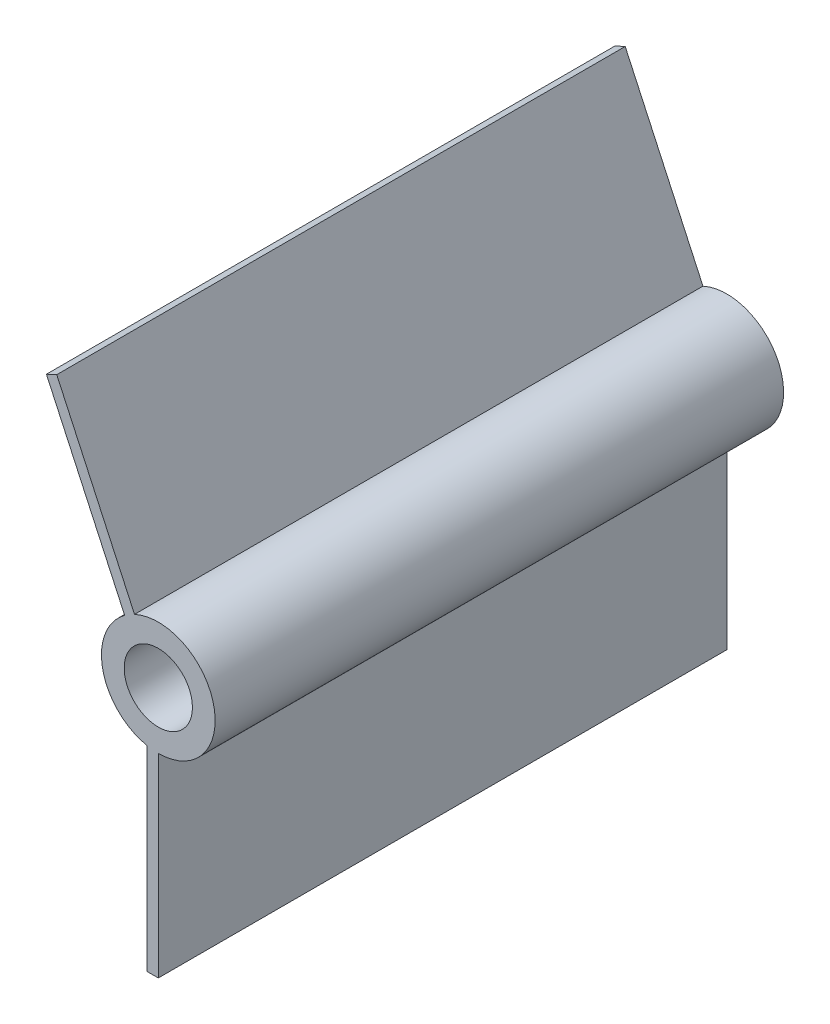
ISO-10303-21;
HEADER;
FILE_DESCRIPTION(('STEP AP214'),'2;1');
FILE_NAME('part.step','',(''),(''),'','','');
FILE_SCHEMA(('AUTOMOTIVE_DESIGN { 1 0 10303 214 1 1 1 1 }'));
ENDSEC;
DATA;
#1=APPLICATION_CONTEXT('core data for automotive mechanical design processes');
#2=APPLICATION_PROTOCOL_DEFINITION('international standard','automotive_design',2000,#1);
#3=PRODUCT_CONTEXT('',#1,'mechanical');
#4=PRODUCT('Part','Part','',(#3));
#5=PRODUCT_RELATED_PRODUCT_CATEGORY('part','',(#4));
#6=PRODUCT_DEFINITION_FORMATION('','',#4);
#7=PRODUCT_DEFINITION_CONTEXT('part definition',#1,'design');
#8=PRODUCT_DEFINITION('design','',#6,#7);
#9=PRODUCT_DEFINITION_SHAPE('','',#8);
#10=(LENGTH_UNIT() NAMED_UNIT(*) SI_UNIT(.MILLI.,.METRE.));
#11=(NAMED_UNIT(*) PLANE_ANGLE_UNIT() SI_UNIT($,.RADIAN.));
#12=(NAMED_UNIT(*) SI_UNIT($,.STERADIAN.) SOLID_ANGLE_UNIT());
#13=UNCERTAINTY_MEASURE_WITH_UNIT(LENGTH_MEASURE(1.E-05),#10,'distance_accuracy_value','');
#14=(GEOMETRIC_REPRESENTATION_CONTEXT(3) GLOBAL_UNCERTAINTY_ASSIGNED_CONTEXT((#13)) GLOBAL_UNIT_ASSIGNED_CONTEXT((#10,
#11,#12)) REPRESENTATION_CONTEXT('',''));
#15=CARTESIAN_POINT('',(0.,0.,0.));
#16=DIRECTION('',(0.,0.,1.));
#17=DIRECTION('',(1.,0.,0.));
#18=AXIS2_PLACEMENT_3D('',#15,#16,#17);
#19=CARTESIAN_POINT('',(-2.,0.,50.));
#20=DIRECTION('',(1.,0.,0.));
#21=DIRECTION('',(0.,0.,-1.));
#22=AXIS2_PLACEMENT_3D('',#19,#20,#21);
#23=PLANE('',#22);
#24=DIRECTION('',(0.,0.,-1.));
#25=VECTOR('',#24,1.);
#26=CARTESIAN_POINT('',(-2.,-9.79795897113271,50.));
#27=LINE('',#26,#25);
#28=CARTESIAN_POINT('',(-2.,-9.79795897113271,-50.));
#29=VERTEX_POINT('',#28);
#30=CARTESIAN_POINT('',(-2.,-9.79795897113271,50.));
#31=VERTEX_POINT('',#30);
#32=EDGE_CURVE('E140',#29,#31,#27,.F.);
#33=ORIENTED_EDGE('',*,*,#32,.F.);
#34=DIRECTION('',(0.,1.,0.));
#35=VECTOR('',#34,1.);
#36=CARTESIAN_POINT('',(-2.,0.,-50.));
#37=LINE('',#36,#35);
#38=CARTESIAN_POINT('',(-2.,-44.2245942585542,-50.));
#39=VERTEX_POINT('',#38);
#40=EDGE_CURVE('E137',#29,#39,#37,.F.);
#41=ORIENTED_EDGE('',*,*,#40,.T.);
#42=DIRECTION('',(0.,0.,-1.));
#43=VECTOR('',#42,1.);
#44=CARTESIAN_POINT('',(-2.,-44.2245942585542,50.));
#45=LINE('',#44,#43);
#46=CARTESIAN_POINT('',(-2.,-44.2245942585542,50.));
#47=VERTEX_POINT('',#46);
#48=EDGE_CURVE('E11',#47,#39,#45,.T.);
#49=ORIENTED_EDGE('',*,*,#48,.F.);
#50=DIRECTION('',(0.,1.,0.));
#51=VECTOR('',#50,1.);
#52=CARTESIAN_POINT('',(-2.,0.,50.));
#53=LINE('',#52,#51);
#54=EDGE_CURVE('E57',#31,#47,#53,.F.);
#55=ORIENTED_EDGE('',*,*,#54,.F.);
#56=EDGE_LOOP('',(#33,#41,#49,#55));
#57=FACE_BOUND('',#56,.T.);
#58=ADVANCED_FACE('F35',(#57),#23,.F.);
#59=CARTESIAN_POINT('',(0.,0.,50.));
#60=DIRECTION('',(1.,0.,0.));
#61=DIRECTION('',(0.,0.,-1.));
#62=AXIS2_PLACEMENT_3D('',#59,#60,#61);
#63=PLANE('',#62);
#64=DIRECTION('',(0.,-1.,0.));
#65=VECTOR('',#64,1.);
#66=CARTESIAN_POINT('',(0.,0.,-50.));
#67=LINE('',#66,#65);
#68=CARTESIAN_POINT('',(0.,-10.,-50.));
#69=VERTEX_POINT('',#68);
#70=CARTESIAN_POINT('',(0.,-44.2245942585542,-50.));
#71=VERTEX_POINT('',#70);
#72=EDGE_CURVE('E143',#69,#71,#67,.T.);
#73=ORIENTED_EDGE('',*,*,#72,.F.);
#74=DIRECTION('',(0.,0.,-1.));
#75=VECTOR('',#74,1.);
#76=CARTESIAN_POINT('',(0.,-10.,50.));
#77=LINE('',#76,#75);
#78=CARTESIAN_POINT('',(0.,-10.,50.));
#79=VERTEX_POINT('',#78);
#80=EDGE_CURVE('E110',#69,#79,#77,.F.);
#81=ORIENTED_EDGE('',*,*,#80,.T.);
#82=DIRECTION('',(0.,-1.,0.));
#83=VECTOR('',#82,1.);
#84=CARTESIAN_POINT('',(0.,0.,50.));
#85=LINE('',#84,#83);
#86=CARTESIAN_POINT('',(0.,-44.2245942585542,50.));
#87=VERTEX_POINT('',#86);
#88=EDGE_CURVE('E121',#79,#87,#85,.T.);
#89=ORIENTED_EDGE('',*,*,#88,.T.);
#90=DIRECTION('',(0.,0.,-1.));
#91=VECTOR('',#90,1.);
#92=CARTESIAN_POINT('',(0.,-44.2245942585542,50.));
#93=LINE('',#92,#91);
#94=EDGE_CURVE('E42',#87,#71,#93,.T.);
#95=ORIENTED_EDGE('',*,*,#94,.T.);
#96=EDGE_LOOP('',(#73,#81,#89,#95));
#97=FACE_BOUND('',#96,.T.);
#98=ADVANCED_FACE('F158',(#97),#63,.T.);
#99=CARTESIAN_POINT('',(-17.8655645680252,38.7575362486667,50.));
#100=DIRECTION('',(0.908160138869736,0.418622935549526,0.));
#101=DIRECTION('',(-0.418622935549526,0.908160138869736,0.));
#102=AXIS2_PLACEMENT_3D('',#99,#100,#101);
#103=PLANE('',#102);
#104=DIRECTION('',(0.418622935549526,-0.908160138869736,0.));
#105=VECTOR('',#104,1.);
#106=CARTESIAN_POINT('',(-17.8655645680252,38.7575362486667,50.));
#107=LINE('',#106,#105);
#108=CARTESIAN_POINT('',(-17.8655645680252,38.7575362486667,50.));
#109=VERTEX_POINT('',#108);
#110=CARTESIAN_POINT('',(-4.18622935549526,9.08160138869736,50.));
#111=VERTEX_POINT('',#110);
#112=EDGE_CURVE('E118',#109,#111,#107,.T.);
#113=ORIENTED_EDGE('',*,*,#112,.T.);
#114=DIRECTION('',(0.,0.,-1.));
#115=VECTOR('',#114,1.);
#116=CARTESIAN_POINT('',(-4.18622935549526,9.08160138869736,50.));
#117=LINE('',#116,#115);
#118=CARTESIAN_POINT('',(-4.18622935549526,9.08160138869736,-50.));
#119=VERTEX_POINT('',#118);
#120=EDGE_CURVE('E99',#111,#119,#117,.T.);
#121=ORIENTED_EDGE('',*,*,#120,.T.);
#122=DIRECTION('',(0.418622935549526,-0.908160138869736,0.));
#123=VECTOR('',#122,1.);
#124=CARTESIAN_POINT('',(-17.8655645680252,38.7575362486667,-50.));
#125=LINE('',#124,#123);
#126=CARTESIAN_POINT('',(-17.8655645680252,38.7575362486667,-50.));
#127=VERTEX_POINT('',#126);
#128=EDGE_CURVE('E145',#127,#119,#125,.T.);
#129=ORIENTED_EDGE('',*,*,#128,.F.);
#130=DIRECTION('',(0.,0.,-1.));
#131=VECTOR('',#130,1.);
#132=CARTESIAN_POINT('',(-17.8655645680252,38.7575362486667,50.));
#133=LINE('',#132,#131);
#134=EDGE_CURVE('E126',#109,#127,#133,.T.);
#135=ORIENTED_EDGE('',*,*,#134,.F.);
#136=EDGE_LOOP('',(#113,#121,#129,#135));
#137=FACE_BOUND('',#136,.T.);
#138=ADVANCED_FACE('F125',(#137),#103,.T.);
#139=CARTESIAN_POINT('',(-19.6818848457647,37.9202903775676,50.));
#140=DIRECTION('',(0.908160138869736,0.418622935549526,0.));
#141=DIRECTION('',(-0.418622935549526,0.908160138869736,0.));
#142=AXIS2_PLACEMENT_3D('',#139,#140,#141);
#143=PLANE('',#142);
#144=DIRECTION('',(0.,0.,-1.));
#145=VECTOR('',#144,1.);
#146=CARTESIAN_POINT('',(-5.91797062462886,8.06086990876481,50.));
#147=LINE('',#146,#145);
#148=CARTESIAN_POINT('',(-5.91797062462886,8.06086990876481,50.));
#149=VERTEX_POINT('',#148);
#150=CARTESIAN_POINT('',(-5.91797062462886,8.06086990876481,-50.));
#151=VERTEX_POINT('',#150);
#152=EDGE_CURVE('E49',#149,#151,#147,.T.);
#153=ORIENTED_EDGE('',*,*,#152,.F.);
#154=DIRECTION('',(0.418622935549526,-0.908160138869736,0.));
#155=VECTOR('',#154,1.);
#156=CARTESIAN_POINT('',(-19.6818848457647,37.9202903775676,50.));
#157=LINE('',#156,#155);
#158=CARTESIAN_POINT('',(-19.6818848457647,37.9202903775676,50.));
#159=VERTEX_POINT('',#158);
#160=EDGE_CURVE('E129',#159,#149,#157,.T.);
#161=ORIENTED_EDGE('',*,*,#160,.F.);
#162=DIRECTION('',(0.,0.,-1.));
#163=VECTOR('',#162,1.);
#164=CARTESIAN_POINT('',(-19.6818848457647,37.9202903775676,50.));
#165=LINE('',#164,#163);
#166=CARTESIAN_POINT('',(-19.6818848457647,37.9202903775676,-50.));
#167=VERTEX_POINT('',#166);
#168=EDGE_CURVE('E136',#159,#167,#165,.T.);
#169=ORIENTED_EDGE('',*,*,#168,.T.);
#170=DIRECTION('',(0.418622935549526,-0.908160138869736,0.));
#171=VECTOR('',#170,1.);
#172=CARTESIAN_POINT('',(-19.6818848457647,37.9202903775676,-50.));
#173=LINE('',#172,#171);
#174=EDGE_CURVE('E150',#167,#151,#173,.T.);
#175=ORIENTED_EDGE('',*,*,#174,.T.);
#176=EDGE_LOOP('',(#153,#161,#169,#175));
#177=FACE_BOUND('',#176,.T.);
#178=ADVANCED_FACE('F183',(#177),#143,.F.);
#179=CARTESIAN_POINT('',(0.,-44.2245942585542,50.));
#180=DIRECTION('',(0.,-1.,0.));
#181=DIRECTION('',(0.,0.,-1.));
#182=AXIS2_PLACEMENT_3D('',#179,#180,#181);
#183=PLANE('',#182);
#184=DIRECTION('',(-1.,0.,0.));
#185=VECTOR('',#184,1.);
#186=CARTESIAN_POINT('',(0.,-44.2245942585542,-50.));
#187=LINE('',#186,#185);
#188=EDGE_CURVE('E139',#71,#39,#187,.T.);
#189=ORIENTED_EDGE('',*,*,#188,.F.);
#190=ORIENTED_EDGE('',*,*,#94,.F.);
#191=DIRECTION('',(-1.,0.,0.));
#192=VECTOR('',#191,1.);
#193=CARTESIAN_POINT('',(0.,-44.2245942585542,50.));
#194=LINE('',#193,#192);
#195=EDGE_CURVE('E131',#87,#47,#194,.T.);
#196=ORIENTED_EDGE('',*,*,#195,.T.);
#197=ORIENTED_EDGE('',*,*,#48,.T.);
#198=EDGE_LOOP('',(#189,#190,#196,#197));
#199=FACE_BOUND('',#198,.T.);
#200=ADVANCED_FACE('F161',(#199),#183,.T.);
#201=CARTESIAN_POINT('',(-19.6818848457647,37.9202903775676,50.));
#202=DIRECTION('',(-0.418622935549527,0.908160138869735,0.));
#203=DIRECTION('',(-0.908160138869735,-0.418622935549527,0.));
#204=AXIS2_PLACEMENT_3D('',#201,#202,#203);
#205=PLANE('',#204);
#206=DIRECTION('',(0.908160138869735,0.418622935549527,0.));
#207=VECTOR('',#206,1.);
#208=CARTESIAN_POINT('',(-19.6818848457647,37.9202903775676,-50.));
#209=LINE('',#208,#207);
#210=EDGE_CURVE('E147',#167,#127,#209,.T.);
#211=ORIENTED_EDGE('',*,*,#210,.F.);
#212=ORIENTED_EDGE('',*,*,#168,.F.);
#213=DIRECTION('',(0.908160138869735,0.418622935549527,0.));
#214=VECTOR('',#213,1.);
#215=CARTESIAN_POINT('',(-19.6818848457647,37.9202903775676,50.));
#216=LINE('',#215,#214);
#217=EDGE_CURVE('E127',#159,#109,#216,.T.);
#218=ORIENTED_EDGE('',*,*,#217,.T.);
#219=ORIENTED_EDGE('',*,*,#134,.T.);
#220=EDGE_LOOP('',(#211,#212,#218,#219));
#221=FACE_BOUND('',#220,.T.);
#222=ADVANCED_FACE('F182',(#221),#205,.T.);
#223=CARTESIAN_POINT('',(0.,0.,50.));
#224=DIRECTION('',(0.,0.,1.));
#225=DIRECTION('',(1.,0.,0.));
#226=AXIS2_PLACEMENT_3D('',#223,#224,#225);
#227=PLANE('',#226);
#228=CARTESIAN_POINT('',(0.,0.,50.));
#229=DIRECTION('',(0.,0.,1.));
#230=DIRECTION('',(1.,0.,0.));
#231=AXIS2_PLACEMENT_3D('',#228,#229,#230);
#232=CIRCLE('',#231,6.);
#233=CARTESIAN_POINT('',(6.,0.,50.));
#234=VERTEX_POINT('',#233);
#235=EDGE_CURVE('E167',#234,#234,#232,.T.);
#236=ORIENTED_EDGE('',*,*,#235,.F.);
#237=EDGE_LOOP('',(#236));
#238=FACE_BOUND('',#237,.T.);
#239=CARTESIAN_POINT('',(0.,0.,50.));
#240=DIRECTION('',(0.,0.,1.));
#241=DIRECTION('',(1.,0.,0.));
#242=AXIS2_PLACEMENT_3D('',#239,#240,#241);
#243=CIRCLE('',#242,10.);
#244=EDGE_CURVE('E122',#149,#31,#243,.T.);
#245=ORIENTED_EDGE('',*,*,#244,.T.);
#246=ORIENTED_EDGE('',*,*,#54,.T.);
#247=ORIENTED_EDGE('',*,*,#195,.F.);
#248=ORIENTED_EDGE('',*,*,#88,.F.);
#249=EDGE_CURVE('E102',#79,#111,#243,.T.);
#250=ORIENTED_EDGE('',*,*,#249,.T.);
#251=ORIENTED_EDGE('',*,*,#112,.F.);
#252=ORIENTED_EDGE('',*,*,#217,.F.);
#253=ORIENTED_EDGE('',*,*,#160,.T.);
#254=EDGE_LOOP('',(#245,#246,#247,#248,#250,#251,#252,#253));
#255=FACE_BOUND('',#254,.T.);
#256=ADVANCED_FACE('F116',(#238,#255),#227,.T.);
#257=CARTESIAN_POINT('',(0.,0.,-50.));
#258=DIRECTION('',(0.,0.,1.));
#259=DIRECTION('',(1.,0.,0.));
#260=AXIS2_PLACEMENT_3D('',#257,#258,#259);
#261=PLANE('',#260);
#262=CARTESIAN_POINT('',(0.,0.,-50.));
#263=DIRECTION('',(0.,0.,1.));
#264=DIRECTION('',(1.,0.,0.));
#265=AXIS2_PLACEMENT_3D('',#262,#263,#264);
#266=CIRCLE('',#265,6.);
#267=CARTESIAN_POINT('',(6.,0.,-50.));
#268=VERTEX_POINT('',#267);
#269=EDGE_CURVE('E170',#268,#268,#266,.T.);
#270=ORIENTED_EDGE('',*,*,#269,.T.);
#271=EDGE_LOOP('',(#270));
#272=FACE_BOUND('',#271,.T.);
#273=ORIENTED_EDGE('',*,*,#40,.F.);
#274=CARTESIAN_POINT('',(0.,0.,-50.));
#275=DIRECTION('',(0.,0.,1.));
#276=DIRECTION('',(1.,0.,0.));
#277=AXIS2_PLACEMENT_3D('',#274,#275,#276);
#278=CIRCLE('',#277,10.);
#279=EDGE_CURVE('E123',#151,#29,#278,.T.);
#280=ORIENTED_EDGE('',*,*,#279,.F.);
#281=ORIENTED_EDGE('',*,*,#174,.F.);
#282=ORIENTED_EDGE('',*,*,#210,.T.);
#283=ORIENTED_EDGE('',*,*,#128,.T.);
#284=EDGE_CURVE('E105',#69,#119,#278,.T.);
#285=ORIENTED_EDGE('',*,*,#284,.F.);
#286=ORIENTED_EDGE('',*,*,#72,.T.);
#287=ORIENTED_EDGE('',*,*,#188,.T.);
#288=EDGE_LOOP('',(#273,#280,#281,#282,#283,#285,#286,#287));
#289=FACE_BOUND('',#288,.T.);
#290=ADVANCED_FACE('F164',(#272,#289),#261,.F.);
#291=CARTESIAN_POINT('',(0.,0.,50.));
#292=DIRECTION('',(0.,0.,-1.));
#293=DIRECTION('',(-1.,0.,0.));
#294=AXIS2_PLACEMENT_3D('',#291,#292,#293);
#295=CYLINDRICAL_SURFACE('',#294,10.);
#296=ORIENTED_EDGE('',*,*,#279,.T.);
#297=ORIENTED_EDGE('',*,*,#32,.T.);
#298=ORIENTED_EDGE('',*,*,#244,.F.);
#299=ORIENTED_EDGE('',*,*,#152,.T.);
#300=EDGE_LOOP('',(#296,#297,#298,#299));
#301=FACE_BOUND('',#300,.T.);
#302=ADVANCED_FACE('F178',(#301),#295,.T.);
#303=ORIENTED_EDGE('',*,*,#80,.F.);
#304=ORIENTED_EDGE('',*,*,#284,.T.);
#305=ORIENTED_EDGE('',*,*,#120,.F.);
#306=ORIENTED_EDGE('',*,*,#249,.F.);
#307=EDGE_LOOP('',(#303,#304,#305,#306));
#308=FACE_BOUND('',#307,.T.);
#309=ADVANCED_FACE('F101',(#308),#295,.T.);
#310=CARTESIAN_POINT('',(0.,0.,-50.));
#311=DIRECTION('',(0.,0.,1.));
#312=DIRECTION('',(1.,0.,0.));
#313=AXIS2_PLACEMENT_3D('',#310,#311,#312);
#314=CYLINDRICAL_SURFACE('',#313,6.);
#315=ORIENTED_EDGE('',*,*,#235,.T.);
#316=EDGE_LOOP('',(#315));
#317=FACE_BOUND('',#316,.T.);
#318=ORIENTED_EDGE('',*,*,#269,.F.);
#319=EDGE_LOOP('',(#318));
#320=FACE_BOUND('',#319,.T.);
#321=ADVANCED_FACE('F215',(#317,#320),#314,.F.);
#322=CLOSED_SHELL('',(#58,#98,#138,#178,#200,#222,#256,#290,#302,#309,#321));
#323=MANIFOLD_SOLID_BREP('B2',#322);
#324=ADVANCED_BREP_SHAPE_REPRESENTATION('',(#18,#323),#14);
#325=SHAPE_DEFINITION_REPRESENTATION(#9,#324);
ENDSEC;
END-ISO-10303-21;
